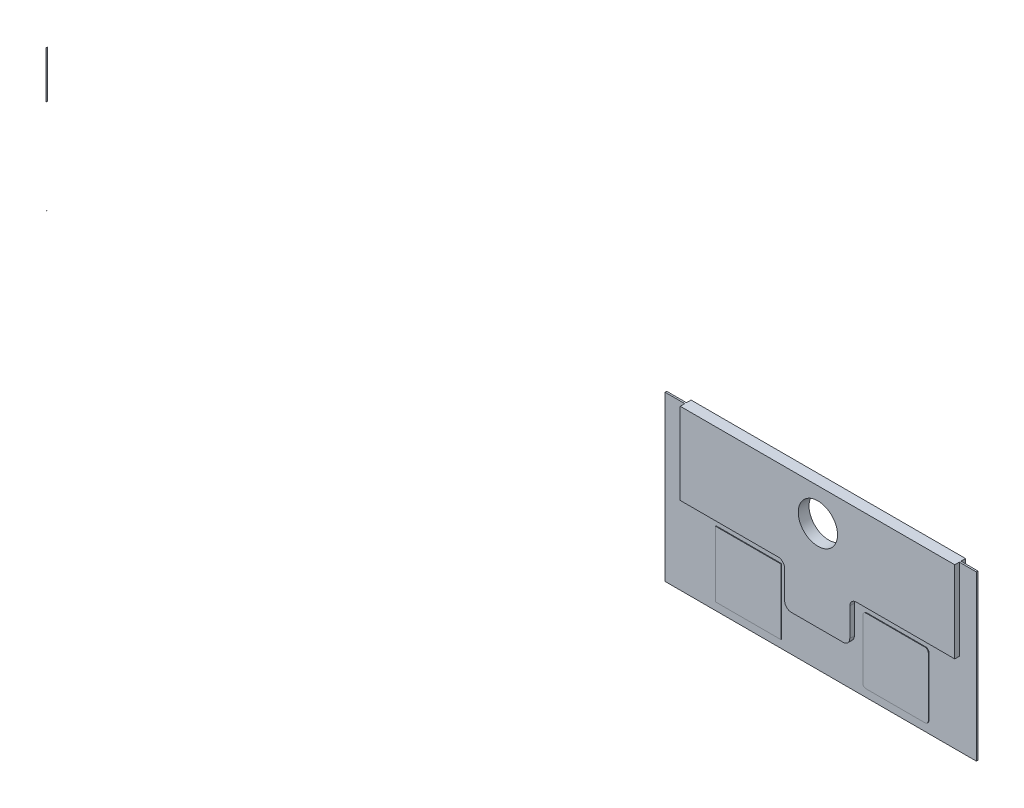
from build123d import *
from build123d.topology import SkipClean

# Parameters (mm, degrees)
SKETCH1_R                = 0.3175
SKETCH1_R_2              = 0.508
SKETCH1_R_3              = 1.524
SKETCH1_R_4              = 3.556
BOSS_EXTRUDE1_DEPTH      = 0.127
SKETCH3_R                = 0.6985
SKETCH3_R_2              = 0.3175
BOSS_EXTRUDE3_DEPTH      = 0.0508
BOSS_EXTRUDE4_START      = 0.0508
SKETCH4_R                = 1.27
SKETCH4_R_2              = 0.508
BOSS_EXTRUDE4_DEPTH      = 0.0508
SKETCH5_R                = 1.27
SKETCH5_R_2              = 0.508
BOSS_EXTRUDE5_DEPTH      = 0.0508
BOSS_EXTRUDE6_DEPTH      = 0.3556
BOSS_EXTRUDE6_DEPTH_BACK = 0.4826
SKETCH6_R                = 3.556
SKETCH6_R_2              = 1.524
SKETCH7_W                = 5.08
SKETCH7_H                = 5.08
BOSS_EXTRUDE7_DEPTH      = 0.0508
BOSS_EXTRUDE8_START      = 0.3556
SKETCH9_R                = 1.524
BOSS_EXTRUDE8_DEPTH      = 0.3556
BOSS_EXTRUDE9_START      = 0.3556
SKETCH10_R               = 1.524
BOSS_EXTRUDE9_DEPTH      = 0.3556
BOSS_EXTRUDE10_START     = 0.3556
SKETCH11_R               = 5.2197
SKETCH11_R_2             = 3.556
SKETCH11_R_3             = 1.524
BOSS_EXTRUDE10_DEPTH     = 0.3556
SKETCH12_W               = 21.2598
SKETCH12_H               = 12.707452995
SKETCH12_R               = 1.524
BOSS_EXTRUDE11_DEPTH     = 0.3556
SKETCH13_W               = 21.2852
SKETCH13_H               = 12.707452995
SKETCH13_R               = 1.524
BOSS_EXTRUDE12_DEPTH     = 0.3556
SKETCH14_R               = 1.778
SKETCH14_R_2             = 1.524
SKETCH14_R_3             = 3.556
SKETCH14_R_4             = 5.2197
BOSS_EXTRUDE13_DEPTH     = 0.3556
BOSS_EXTRUDE17_DEPTH     = 0.0508
SKETCH18_W               = 1.099038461
SKETCH18_H               = 0.529166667
BOSS_EXTRUDE19_DEPTH     = 0.0508
SKETCH19_W               = 48.006
SKETCH19_H               = 20.503059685
CUT_EXTRUDE1_DEPTH       = 2.54
SKETCH20_W               = 52.880424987
SKETCH20_H               = 27.51501788
CUT_EXTRUDE3_DEPTH       = 2.54


with BuildPart() as part:
    # Sketch1 → Boss-Extrude1 (new body)
    with BuildSketch(Plane.XY.offset(0.39116)):
        Polygon((156.11155468, 251.50762754), (156.337, 251.47794764), (256.286000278, 251.47794764), (256.286000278, 251.48474214), (256.491552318, 251.45768098), (256.683098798, 251.378339), (256.847581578, 251.25212894), (256.973791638, 251.08764616), (257.053133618, 250.89609968), (257.080194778, 250.69054764), (257.073399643, 247.66794764), (257.062440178, 247.66794764), (257.106087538, 247.3364116), (257.234055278, 247.02746886), (257.437623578, 246.76217348), (257.702918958, 246.55860518), (258.011861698, 246.43063744), (258.343398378, 246.386990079), (268.503400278, 246.397947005), (268.503400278, 246.38698754), (268.834936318, 246.4306349), (269.143879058, 246.55860264), (269.409174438, 246.76217094), (269.612742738, 247.02746632), (269.740710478, 247.33640906), (269.784357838, 247.6679451), (269.773400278, 250.63974764), (269.766166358, 250.63974764), (269.794975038, 250.85856102), (269.879432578, 251.0624646), (270.013788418, 251.2375595), (270.188883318, 251.37191534), (270.392786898, 251.45637288), (270.611600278, 251.48518156), (271.018000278, 251.47794764), (271.018000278, 251.46794258), (271.730094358, 251.50793234), (272.433234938, 251.62740124), (273.118577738, 251.8248456), (273.777501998, 252.0977813), (274.401727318, 252.4427768), (274.983397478, 252.85549632), (275.515202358, 253.33074556), (275.990451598, 253.86255044), (276.403171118, 254.4442206), (276.748166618, 255.06844592), (277.021102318, 255.72737018), (277.218546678, 256.41271298), (277.338015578, 257.11585356), (277.378005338, 257.82794764), (277.337522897, 258.536938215), (277.21811535, 259.240089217), (277.020730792, 259.925449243), (276.747852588, 260.584397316), (276.402911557, 261.208652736), (275.990242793, 261.790358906), (275.515039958, 262.322205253), (274.983276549, 262.797500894), (274.401642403, 263.210271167), (273.777447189, 263.555321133), (273.118546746, 263.828314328), (272.433221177, 264.025818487), (271.730091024, 264.14534874), (271.018000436, 264.185400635), (156.3624, 264.185400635), (156.3624, 264.19307334), (156.13032528, 264.16251968), (155.9140646, 264.0729415), (155.72835758, 263.93044496), (155.58586104, 263.74473794), (155.49628286, 263.52847726), (155.4657292, 263.296401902), (155.4734, 252.349), (155.46594764, 252.349), (155.49562754, 252.12355468), (155.5826454, 251.91347382), (155.72107286, 251.73307286), (155.90147382, 251.5946454), align=None)
        with Locations(Location((269.24, 259.7658, 0), (0, 0, 180))):
            Circle(SKETCH1_R, mode=Mode.SUBTRACT)
        with Locations(Location((270.9164, 258.8006, 0), (0, 0, 180))):
            Circle(SKETCH1_R, mode=Mode.SUBTRACT)
        with Locations(Location((267.5636, 258.8006, 0), (0, 0, 180))):
            Circle(SKETCH1_R, mode=Mode.SUBTRACT)
        with Locations(Location((269.24, 257.8354, 0), (0, 0, 180))):
            Circle(SKETCH1_R, mode=Mode.SUBTRACT)
        with Locations(Location((270.9164, 256.8702, 0), (0, 0, 180))):
            Circle(SKETCH1_R, mode=Mode.SUBTRACT)
        with Locations(Location((269.24, 255.905, 0), (0, 0, 180))):
            Circle(SKETCH1_R, mode=Mode.SUBTRACT)
        with Locations(Location((267.5636, 256.8702, 0), (0, 0, 180))):
            Circle(SKETCH1_R, mode=Mode.SUBTRACT)
        with Locations(Location((265.9634, 248.9454, 0), (0, 0, 180))):
            Circle(SKETCH1_R_2, mode=Mode.SUBTRACT)
        with Locations(Location((215.6714, 261.6454, 0), (0, 0, 180))):
            Circle(SKETCH1_R_3, mode=Mode.SUBTRACT)
        with Locations(Location((235.077, 261.6454, 0), (0, 0, 180))):
            Circle(SKETCH1_R_3, mode=Mode.SUBTRACT)
        with Locations(Location((171.704, 261.6454, 0), (0, 0, 180))):
            Circle(SKETCH1_R_3, mode=Mode.SUBTRACT)
        with Locations(Location((191.0842, 261.6454, 0), (0, 0, 180))):
            Circle(SKETCH1_R_3, mode=Mode.SUBTRACT)
        with Locations(Location((244.9068, 257.8354, 0), (0, 0, 180))):
            Circle(SKETCH1_R_4, mode=Mode.SUBTRACT)
        with Locations(Location((260.8834, 248.9454, 0), (0, 0, 180))):
            Circle(SKETCH1_R_2, mode=Mode.SUBTRACT)
        with Locations(Location((161.8742, 257.8354, 0), (0, 0, 180))):
            Circle(SKETCH1_R_4, mode=Mode.SUBTRACT)
    extrude(amount=-BOSS_EXTRUDE1_DEPTH)

    # Sketch3 → Boss-Extrude3 (add)
    # profile 1 of 7: a face of its own
    with BuildSketch(Plane.XY.offset(0.26416)):
        with Locations((269.24, 259.7658)):
            Circle(SKETCH3_R)
        with Locations((269.24, 259.7658)):
            Circle(SKETCH3_R_2, mode=Mode.SUBTRACT)
    # profile 2 of 7: a face of its own
    with BuildSketch(Plane.XY.offset(0.26416)):
        with Locations((267.5636, 258.8006)):
            Circle(SKETCH3_R)
        with Locations((267.5636, 258.8006)):
            Circle(SKETCH3_R_2, mode=Mode.SUBTRACT)
    # profile 3 of 7: a face of its own
    with BuildSketch(Plane.XY.offset(0.26416)):
        with Locations((267.5636, 256.8702)):
            Circle(SKETCH3_R)
        with Locations((267.5636, 256.8702)):
            Circle(SKETCH3_R_2, mode=Mode.SUBTRACT)
    # profile 4 of 7: a face of its own
    with BuildSketch(Plane.XY.offset(0.26416)):
        with Locations((269.24, 255.905)):
            Circle(SKETCH3_R)
        with Locations((269.24, 255.905)):
            Circle(SKETCH3_R_2, mode=Mode.SUBTRACT)
    # profile 5 of 7: a face of its own
    with BuildSketch(Plane.XY.offset(0.26416)):
        with Locations((269.24, 257.8354)):
            Circle(SKETCH3_R)
        with Locations((269.24, 257.8354)):
            Circle(SKETCH3_R_2, mode=Mode.SUBTRACT)
    # profile 6 of 7: a face of its own
    with BuildSketch(Plane.XY.offset(0.26416)):
        with Locations((270.9164, 258.8006)):
            Circle(SKETCH3_R)
        with Locations((270.9164, 258.8006)):
            Circle(SKETCH3_R_2, mode=Mode.SUBTRACT)
    # profile 7 of 7: a face of its own
    with BuildSketch(Plane.XY.offset(0.26416)):
        with Locations((270.9164, 256.8702)):
            Circle(SKETCH3_R)
        with Locations((270.9164, 256.8702)):
            Circle(SKETCH3_R_2, mode=Mode.SUBTRACT)
    extrude(amount=-BOSS_EXTRUDE3_DEPTH)

    # Sketch4 → Boss-Extrude4 (add)
    # profile 1 of 2: a face of its own
    with BuildSketch(Plane.XY.offset(0.39116).offset(BOSS_EXTRUDE4_START)):
        with Locations((260.8834, 248.9454)):
            Circle(SKETCH4_R)
        with Locations((260.8834, 248.9454)):
            Circle(SKETCH4_R_2, mode=Mode.SUBTRACT)
    # profile 2 of 2: a face of its own
    with BuildSketch(Plane.XY.offset(0.39116).offset(BOSS_EXTRUDE4_START)):
        with Locations((265.9634, 248.9454)):
            Circle(SKETCH4_R)
        with Locations((265.9634, 248.9454)):
            Circle(SKETCH4_R_2, mode=Mode.SUBTRACT)
    extrude(amount=-BOSS_EXTRUDE4_DEPTH)

    # Sketch5 → Boss-Extrude5 (add)
    # profile 1 of 2: a face of its own
    with BuildSketch(Plane.XY.offset(0.26416)):
        with Locations((265.9634, 248.9454)):
            Circle(SKETCH5_R)
        with Locations((265.9634, 248.9454)):
            Circle(SKETCH5_R_2, mode=Mode.SUBTRACT)
    # profile 2 of 2: a face of its own
    with BuildSketch(Plane.XY.offset(0.26416)):
        with Locations((260.8834, 248.9454)):
            Circle(SKETCH5_R)
        with Locations((260.8834, 248.9454)):
            Circle(SKETCH5_R_2, mode=Mode.SUBTRACT)
    extrude(amount=-BOSS_EXTRUDE5_DEPTH)

    # Sketch6 → Boss-Extrude6 (add, two sides: drawn at the far end of the back side and taken through both)
    with SkipClean():  # the faces are left unmerged after this step: merging them gives an invalid solid
        with BuildSketch(Plane.XY.offset(0.39116).offset(-BOSS_EXTRUDE6_DEPTH_BACK)):
            with BuildLine():
                Line((177.79487504, 251.47794764), (177.79487504, 264.185402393))
                Line((177.79487504, 264.185402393), (156.3624, 264.185400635))
                ThreePointArc((156.3624, 264.185400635), (155.739568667, 263.929838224), (155.46827504, 263.313696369))
                Line((155.46827504, 263.313696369), (155.46827504, 252.300953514))
                ThreePointArc((155.46827504, 252.300953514), (155.743741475, 251.721727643), (156.337, 251.47794764))
                Line((156.337, 251.47794764), (177.79487504, 251.47794764))
            make_face()
            with Locations((161.8742, 257.8354)):
                Circle(SKETCH6_R, mode=Mode.SUBTRACT)
            with Locations((171.704, 261.6454)):
                Circle(SKETCH6_R_2, mode=Mode.SUBTRACT)
        extrude(amount=BOSS_EXTRUDE6_DEPTH + BOSS_EXTRUDE6_DEPTH_BACK)

    # Sketch7 → Boss-Extrude7 (add)
    with SkipClean():  # the faces are left unmerged after this step: merging them gives an invalid solid
        with BuildSketch(Plane.XY.offset(0.39116)):
            with Locations((185.3692, 254.65294764)):
                Rectangle(SKETCH7_W, SKETCH7_H)
            with BuildLine():
                Line((194.2592, 256.93894764), (194.2592, 252.36694764))
                ThreePointArc((194.2592, 252.36694764), (194.333594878, 252.187342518), (194.5132, 252.11294764))
                Line((194.5132, 252.11294764), (199.0852, 252.11294764))
                ThreePointArc((199.0852, 252.11294764), (199.264805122, 252.187342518), (199.3392, 252.36694764))
                Line((199.3392, 252.36694764), (199.3392, 256.93894764))
                ThreePointArc((199.3392, 256.93894764), (199.264805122, 257.118552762), (199.0852, 257.19294764))
                Line((199.0852, 257.19294764), (194.5132, 257.19294764))
                ThreePointArc((194.5132, 257.19294764), (194.333594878, 257.118552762), (194.2592, 256.93894764))
            make_face()
            with Locations((209.9564, 254.65294764)):
                Rectangle(SKETCH7_W, SKETCH7_H)
            with BuildLine():
                Line((219.1004, 257.19294764), (223.6724, 257.19294764))
                ThreePointArc((223.6724, 257.19294764), (223.852005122, 257.118552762), (223.9264, 256.93894764))
                Line((223.9264, 256.93894764), (223.9264, 252.36694764))
                ThreePointArc((223.9264, 252.36694764), (223.852005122, 252.187342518), (223.6724, 252.11294764))
                Line((223.6724, 252.11294764), (219.1004, 252.11294764))
                ThreePointArc((219.1004, 252.11294764), (218.920794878, 252.187342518), (218.8464, 252.36694764))
                Line((218.8464, 252.36694764), (218.8464, 256.93894764))
                ThreePointArc((218.8464, 256.93894764), (218.920794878, 257.118552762), (219.1004, 257.19294764))
            make_face()
        extrude(amount=BOSS_EXTRUDE7_DEPTH)

    # Sketch9 → Boss-Extrude8 (add)
    with SkipClean():  # the faces are left unmerged after this step: merging them gives an invalid solid
        with BuildSketch(Plane.XY.offset(0.39116).offset(BOSS_EXTRUDE8_START)):
            with BuildLine():
                ThreePointArc((188.602516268, 257.353947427), (188.453726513, 257.713157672), (188.094516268, 257.861947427))
                Line((188.094516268, 257.861947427), (180.79207504, 257.861947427))
                Line((180.79207504, 257.861947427), (180.79207504, 264.18540068))
                Line((180.79207504, 264.18540068), (202.05187504, 264.185401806))
                Line((202.05187504, 264.185401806), (202.05187504, 257.861947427))
                Line((202.05187504, 257.861947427), (194.107504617, 257.861947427))
                ThreePointArc((194.107504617, 257.861947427), (193.748294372, 257.713157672), (193.599504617, 257.353947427))
                Line((193.599504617, 257.353947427), (193.599504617, 255.16094764))
                ThreePointArc((193.599504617, 255.16094764), (193.450714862, 254.801737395), (193.091504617, 254.65294764))
                Line((193.091504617, 254.65294764), (189.110516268, 254.65294764))
                ThreePointArc((189.110516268, 254.65294764), (188.751306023, 254.801737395), (188.602516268, 255.16094764))
                Line((188.602516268, 255.16094764), (188.602516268, 257.353947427))
            make_face()
            with Locations((191.0842, 261.6454)):
                Circle(SKETCH9_R, mode=Mode.SUBTRACT)
        extrude(amount=-BOSS_EXTRUDE8_DEPTH)

    # Sketch10 → Boss-Extrude9 (add)
    with SkipClean():  # the faces are left unmerged after this step: merging them gives an invalid solid
        with BuildSketch(Plane.XY.offset(0.39116).offset(BOSS_EXTRUDE9_START)):
            with BuildLine():
                ThreePointArc((213.098791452, 257.353947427), (212.950001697, 257.713157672), (212.590791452, 257.861947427))
                Line((212.590791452, 257.861947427), (204.99827504, 257.861947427))
                Line((204.99827504, 257.861947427), (204.99827504, 264.185400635))
                Line((204.99827504, 264.185400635), (226.28347504, 264.185400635))
                Line((226.28347504, 264.185400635), (226.28347504, 257.861947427))
                Line((226.28347504, 257.861947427), (218.650909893, 257.861947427))
                ThreePointArc((218.650909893, 257.861947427), (218.291699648, 257.713157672), (218.142909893, 257.353947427))
                Line((218.142909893, 257.353947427), (218.142909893, 255.16094764))
                ThreePointArc((218.142909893, 255.16094764), (217.994120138, 254.801737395), (217.634909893, 254.65294764))
                Line((217.634909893, 254.65294764), (213.606791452, 254.65294764))
                ThreePointArc((213.606791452, 254.65294764), (213.247581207, 254.801737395), (213.098791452, 255.16094764))
                Line((213.098791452, 255.16094764), (213.098791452, 257.353947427))
            make_face()
            with Locations((215.6714, 261.6454)):
                Circle(SKETCH10_R, mode=Mode.SUBTRACT)
        extrude(amount=-BOSS_EXTRUDE9_DEPTH)

    # Sketch11 → Boss-Extrude10 (add)
    with SkipClean():  # the faces are left unmerged after this step: merging them gives an invalid solid
        with BuildSketch(Plane.XY.offset(0.39116).offset(BOSS_EXTRUDE10_START)):
            with BuildLine():
                ThreePointArc((271.730091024, 264.14534874), (277.367721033, 257.826642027), (271.730094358, 251.50793234))
                Line((271.730094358, 251.50793234), (229.22987504, 251.478351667))
                Line((229.22987504, 251.478351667), (229.22987504, 264.184362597))
                Line((229.22987504, 264.184362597), (271.730091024, 264.14534874))
            make_face()
            with Locations((269.24, 257.8354)):
                Circle(SKETCH11_R, mode=Mode.SUBTRACT)
            with Locations((244.9068, 257.8354)):
                Circle(SKETCH11_R_2, mode=Mode.SUBTRACT)
            with Locations((235.077, 261.6454)):
                Circle(SKETCH11_R_3, mode=Mode.SUBTRACT)
        extrude(amount=-BOSS_EXTRUDE10_DEPTH)

    # Sketch12 → Boss-Extrude11 (add)
    with SkipClean():  # the faces are left unmerged after this step: merging them gives an invalid solid
        with BuildSketch(Plane(origin=(0, 0, 0.26416), x_dir=(-1, 0, 0), z_dir=(0, 0, -1))):
            with Locations((-191.42197504, 257.831674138)):
                Rectangle(SKETCH12_W, SKETCH12_H)
            with Locations((-191.0842, 261.6454)):
                Circle(SKETCH12_R, mode=Mode.SUBTRACT)
        extrude(amount=BOSS_EXTRUDE11_DEPTH)

    # Sketch13 → Boss-Extrude12 (add)
    with SkipClean():  # the faces are left unmerged after this step: merging them gives an invalid solid
        with BuildSketch(Plane(origin=(0, 0, 0.26416), x_dir=(-1, 0, 0), z_dir=(0, 0, -1))):
            with Locations((-215.64087504, 257.831674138)):
                Rectangle(SKETCH13_W, SKETCH13_H)
            with Locations(Location((-215.6714, 261.6454, 0), (0, 0, 180))):
                Circle(SKETCH13_R, mode=Mode.SUBTRACT)
        extrude(amount=BOSS_EXTRUDE12_DEPTH)

    # Sketch14 → Boss-Extrude13 (add)
    with SkipClean():  # the faces are left unmerged after this step: merging them gives an invalid solid
        with BuildSketch(Plane(origin=(0, 0, 0.26416), x_dir=(-1, 0, 0), z_dir=(0, 0, -1))):
            with BuildLine():
                Line((-271.015154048, 251.477947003), (-270.605817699, 251.477947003))
                ThreePointArc((-270.605817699, 251.477947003), (-270.016863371, 251.23040133), (-269.773400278, 250.63974764))
                Line((-269.773400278, 250.63974764), (-269.784357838, 247.6679451))
                ThreePointArc((-269.784357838, 247.6679451), (-269.410770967, 246.763750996), (-268.503400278, 246.397947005))
                Line((-268.503400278, 246.397947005), (-258.343398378, 246.386990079))
                ThreePointArc((-258.343398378, 246.386990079), (-257.445612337, 246.770161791), (-257.062440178, 247.66794764))
                Line((-257.062440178, 247.66794764), (-257.080194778, 250.69054764))
                ThreePointArc((-257.080194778, 250.69054764), (-256.844162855, 251.246702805), (-256.286000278, 251.47794764))
                Line((-256.286000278, 251.47794764), (-229.22987504, 251.47794764))
                Line((-229.22987504, 251.47794764), (-229.22987504, 264.184362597))
                Line((-229.22987504, 264.184362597), (-271.730091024, 264.14534874))
                ThreePointArc((-271.730091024, 264.14534874), (-277.358934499, 257.473785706), (-271.015154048, 251.477947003))
            make_face()
            with Locations((-260.8834, 248.9454)):
                Circle(SKETCH14_R, mode=Mode.SUBTRACT)
            with Locations((-265.9634, 248.9454)):
                Circle(SKETCH14_R, mode=Mode.SUBTRACT)
            with Locations((-235.077, 261.6454)):
                Circle(SKETCH14_R_2, mode=Mode.SUBTRACT)
            with Locations((-244.9068, 257.8354)):
                Circle(SKETCH14_R_3, mode=Mode.SUBTRACT)
            with Locations((-269.24, 257.8354)):
                Circle(SKETCH14_R_4, mode=Mode.SUBTRACT)
        extrude(amount=BOSS_EXTRUDE13_DEPTH)

    # Sketch17 → Boss-Extrude17 (add)
    with SkipClean():  # the faces are left unmerged after this step: merging them gives an invalid solid
        with BuildSketch(Plane(origin=(0, 0, 0.26416), x_dir=(-1, 0, 0), z_dir=(0, 0, -1))):
            with BuildLine():
                Line((-267.284159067, 258.170767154), (-265.332275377, 258.166685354))
                Line((-265.332275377, 258.166685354), (-261.5184, 254.422244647))
                Line((-261.5184, 254.422244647), (-261.5184, 250.045888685))
                ThreePointArc((-261.5184, 250.045888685), (-260.883385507, 250.074491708), (-260.2484, 250.045252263))
                Line((-260.2484, 250.045252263), (-260.2484, 254.955143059))
                Line((-260.2484, 254.955143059), (-264.811939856, 259.4356))
                Line((-264.811939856, 259.4356), (-267.284163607, 259.44076994))
                ThreePointArc((-267.284163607, 259.44076994), (-266.982140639, 258.805769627), (-267.284159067, 258.170767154))
            make_face()
            with BuildLine():
                Line((-267.284150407, 256.230035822), (-266.701334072, 256.230676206))
                Line((-266.701334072, 256.230676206), (-266.5984, 256.146143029))
                Line((-266.5984, 256.146143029), (-266.5984, 250.045243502))
                ThreePointArc((-266.5984, 250.045243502), (-265.963400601, 250.13231716), (-265.3284, 250.045252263))
                Line((-265.3284, 250.045252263), (-265.3284, 256.746549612))
                Line((-265.3284, 256.746549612), (-266.247290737, 257.501175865))
                Line((-266.247290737, 257.501175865), (-267.284165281, 257.500036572))
                ThreePointArc((-267.284165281, 257.500036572), (-266.919694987, 256.865040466), (-267.284150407, 256.230035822))
            make_face()
        extrude(amount=BOSS_EXTRUDE17_DEPTH)

    # Sketch18 → Boss-Extrude19 (add)
    with SkipClean():  # the faces are left unmerged after this step: merging them gives an invalid solid
        with BuildSketch(Plane.XY.offset(0.39116)):
            Polygon((258.287631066, 250.186779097), (258.287631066, 250.960176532), (258.816797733, 250.960176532), (258.816797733, 250.186779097), (259.630900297, 250.186779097), (259.630900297, 249.65761243), (258.816797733, 249.65761243), (258.816797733, 248.884214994), (258.287631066, 248.884214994), (258.287631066, 249.65761243), (257.473528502, 249.65761243), (257.473528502, 250.186779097), align=None)
            with Locations((268.117919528, 249.55584961)):
                Rectangle(SKETCH18_W, SKETCH18_H)
        extrude(amount=BOSS_EXTRUDE19_DEPTH)

    # Sketch19 → Cut-Extrude1 (cut)
    with BuildSketch(Plane.XY.offset(0.74676)):
        with Locations((179.47127504, 257.317951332)):
            Rectangle(SKETCH19_W, SKETCH19_H)
    extrude(amount=-CUT_EXTRUDE1_DEPTH, mode=Mode.SUBTRACT)


with BuildPart() as cut_extrude1_piece_1:
    # of the separate pieces the step leaves, piece 1, a body of its own (cut_extrude1_pieces)
    add(part.part.solids().sort_by_distance((203.47427504, 251.47794764, 0.39116))[0])

    # Sketch20 → Cut-Extrude3 (cut)
    with SkipClean():  # the faces are left unmerged after this step: merging them gives an invalid solid
        with BuildSketch(Plane.XY.offset(0.74676)):
            with Locations((254.044487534, 254.54255871)):
                Rectangle(SKETCH20_W, SKETCH20_H)
        extrude(amount=-CUT_EXTRUDE3_DEPTH, mode=Mode.SUBTRACT)


with BuildPart() as cut_extrude1_piece_2:
    # of the separate pieces the step leaves, piece 2, a body of its own (cut_extrude1_pieces)
    add(part.part.solids().sort_by_distance((155.46827504, 259.66309944, 0.39116))[0])


with BuildPart() as cut_extrude1_piece_3:
    # of the separate pieces the step leaves, piece 3, a body of its own (cut_extrude1_pieces)
    add(part.part.solids().sort_by_distance((155.46594764, 252.349, 0.39116))[0])


solid = Compound([cut_extrude1_piece_1.part, cut_extrude1_piece_2.part, cut_extrude1_piece_3.part])
